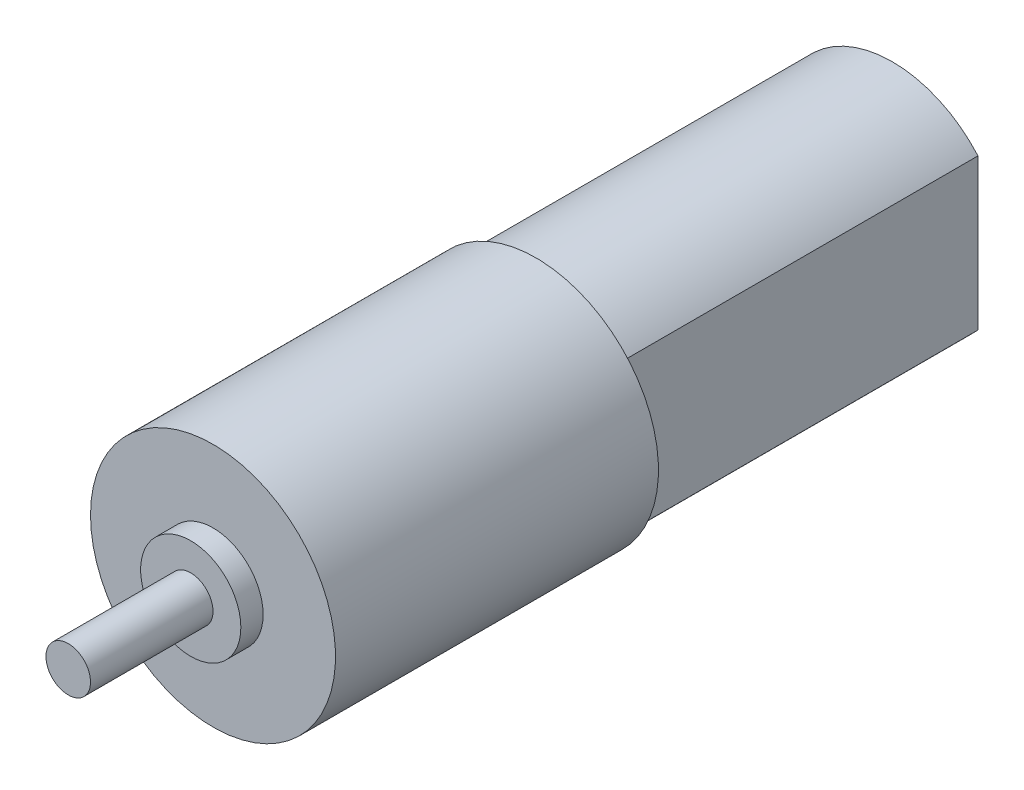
ISO-10303-21;
HEADER;
FILE_DESCRIPTION(('STEP AP214'),'2;1');
FILE_NAME('part.step','',(''),(''),'','','');
FILE_SCHEMA(('AUTOMOTIVE_DESIGN { 1 0 10303 214 1 1 1 1 }'));
ENDSEC;
DATA;
#1=APPLICATION_CONTEXT('core data for automotive mechanical design processes');
#2=APPLICATION_PROTOCOL_DEFINITION('international standard','automotive_design',2000,#1);
#3=PRODUCT_CONTEXT('',#1,'mechanical');
#4=PRODUCT('Part','Part','',(#3));
#5=PRODUCT_RELATED_PRODUCT_CATEGORY('part','',(#4));
#6=PRODUCT_DEFINITION_FORMATION('','',#4);
#7=PRODUCT_DEFINITION_CONTEXT('part definition',#1,'design');
#8=PRODUCT_DEFINITION('design','',#6,#7);
#9=PRODUCT_DEFINITION_SHAPE('','',#8);
#10=(LENGTH_UNIT() NAMED_UNIT(*) SI_UNIT(.MILLI.,.METRE.));
#11=(NAMED_UNIT(*) PLANE_ANGLE_UNIT() SI_UNIT($,.RADIAN.));
#12=(NAMED_UNIT(*) SI_UNIT($,.STERADIAN.) SOLID_ANGLE_UNIT());
#13=UNCERTAINTY_MEASURE_WITH_UNIT(LENGTH_MEASURE(1.E-05),#10,'distance_accuracy_value','');
#14=(GEOMETRIC_REPRESENTATION_CONTEXT(3) GLOBAL_UNCERTAINTY_ASSIGNED_CONTEXT((#13)) GLOBAL_UNIT_ASSIGNED_CONTEXT((#10,
#11,#12)) REPRESENTATION_CONTEXT('',''));
#15=CARTESIAN_POINT('',(0.,0.,0.));
#16=DIRECTION('',(0.,0.,1.));
#17=DIRECTION('',(1.,0.,0.));
#18=AXIS2_PLACEMENT_3D('',#15,#16,#17);
#19=CARTESIAN_POINT('',(0.,0.,61.));
#20=DIRECTION('',(0.,0.,-1.));
#21=DIRECTION('',(-1.,0.,0.));
#22=AXIS2_PLACEMENT_3D('',#19,#20,#21);
#23=CYLINDRICAL_SURFACE('',#22,11.);
#24=CARTESIAN_POINT('',(0.,0.,61.));
#25=DIRECTION('',(0.,0.,1.));
#26=DIRECTION('',(1.,0.,0.));
#27=AXIS2_PLACEMENT_3D('',#24,#25,#26);
#28=CIRCLE('',#27,11.);
#29=CARTESIAN_POINT('',(-11.,0.,61.));
#30=VERTEX_POINT('',#29);
#31=EDGE_CURVE('E108',#30,#30,#28,.T.);
#32=CARTESIAN_POINT('',(0.,0.,32.));
#33=DIRECTION('',(0.,0.,-1.));
#34=DIRECTION('',(-1.,0.,0.));
#35=AXIS2_PLACEMENT_3D('',#32,#33,#34);
#36=CIRCLE('',#35,11.);
#37=CARTESIAN_POINT('',(-11.,0.,32.));
#38=VERTEX_POINT('',#37);
#39=EDGE_CURVE('E113',#38,#38,#36,.T.);
#40=CARTESIAN_POINT('',(-11.,0.,61.));
#41=CARTESIAN_POINT('',(-11.,0.,60.6979166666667));
#42=CARTESIAN_POINT('',(-11.,0.,60.3958333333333));
#43=CARTESIAN_POINT('',(-11.,0.,59.7916666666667));
#44=CARTESIAN_POINT('',(-11.,0.,59.4895833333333));
#45=CARTESIAN_POINT('',(-11.,0.,58.8854166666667));
#46=CARTESIAN_POINT('',(-11.,0.,58.5833333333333));
#47=CARTESIAN_POINT('',(-11.,0.,57.9791666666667));
#48=CARTESIAN_POINT('',(-11.,0.,57.6770833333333));
#49=CARTESIAN_POINT('',(-11.,0.,57.0729166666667));
#50=CARTESIAN_POINT('',(-11.,0.,56.7708333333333));
#51=CARTESIAN_POINT('',(-11.,0.,56.1666666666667));
#52=CARTESIAN_POINT('',(-11.,0.,55.8645833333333));
#53=CARTESIAN_POINT('',(-11.,0.,55.2604166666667));
#54=CARTESIAN_POINT('',(-11.,0.,54.9583333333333));
#55=CARTESIAN_POINT('',(-11.,0.,54.3541666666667));
#56=CARTESIAN_POINT('',(-11.,0.,54.0520833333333));
#57=CARTESIAN_POINT('',(-11.,0.,53.4479166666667));
#58=CARTESIAN_POINT('',(-11.,0.,53.1458333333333));
#59=CARTESIAN_POINT('',(-11.,0.,52.5416666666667));
#60=CARTESIAN_POINT('',(-11.,0.,52.2395833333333));
#61=CARTESIAN_POINT('',(-11.,0.,51.6354166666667));
#62=CARTESIAN_POINT('',(-11.,0.,51.3333333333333));
#63=CARTESIAN_POINT('',(-11.,0.,50.7291666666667));
#64=CARTESIAN_POINT('',(-11.,0.,50.4270833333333));
#65=CARTESIAN_POINT('',(-11.,0.,49.8229166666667));
#66=CARTESIAN_POINT('',(-11.,0.,49.5208333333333));
#67=CARTESIAN_POINT('',(-11.,0.,48.9166666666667));
#68=CARTESIAN_POINT('',(-11.,0.,48.6145833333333));
#69=CARTESIAN_POINT('',(-11.,0.,48.0104166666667));
#70=CARTESIAN_POINT('',(-11.,0.,47.7083333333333));
#71=CARTESIAN_POINT('',(-11.,0.,47.1041666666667));
#72=CARTESIAN_POINT('',(-11.,0.,46.8020833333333));
#73=CARTESIAN_POINT('',(-11.,0.,46.1979166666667));
#74=CARTESIAN_POINT('',(-11.,0.,45.8958333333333));
#75=CARTESIAN_POINT('',(-11.,0.,45.2916666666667));
#76=CARTESIAN_POINT('',(-11.,0.,44.9895833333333));
#77=CARTESIAN_POINT('',(-11.,0.,44.3854166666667));
#78=CARTESIAN_POINT('',(-11.,0.,44.0833333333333));
#79=CARTESIAN_POINT('',(-11.,0.,43.4791666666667));
#80=CARTESIAN_POINT('',(-11.,0.,43.1770833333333));
#81=CARTESIAN_POINT('',(-11.,0.,42.5729166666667));
#82=CARTESIAN_POINT('',(-11.,0.,42.2708333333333));
#83=CARTESIAN_POINT('',(-11.,0.,41.6666666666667));
#84=CARTESIAN_POINT('',(-11.,0.,41.3645833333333));
#85=CARTESIAN_POINT('',(-11.,0.,40.7604166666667));
#86=CARTESIAN_POINT('',(-11.,0.,40.4583333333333));
#87=CARTESIAN_POINT('',(-11.,0.,39.8541666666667));
#88=CARTESIAN_POINT('',(-11.,0.,39.5520833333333));
#89=CARTESIAN_POINT('',(-11.,0.,38.9479166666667));
#90=CARTESIAN_POINT('',(-11.,0.,38.6458333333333));
#91=CARTESIAN_POINT('',(-11.,0.,38.0416666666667));
#92=CARTESIAN_POINT('',(-11.,0.,37.7395833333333));
#93=CARTESIAN_POINT('',(-11.,0.,37.1354166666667));
#94=CARTESIAN_POINT('',(-11.,0.,36.8333333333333));
#95=CARTESIAN_POINT('',(-11.,0.,36.2291666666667));
#96=CARTESIAN_POINT('',(-11.,0.,35.9270833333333));
#97=CARTESIAN_POINT('',(-11.,0.,35.3229166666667));
#98=CARTESIAN_POINT('',(-11.,0.,35.0208333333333));
#99=CARTESIAN_POINT('',(-11.,0.,34.4166666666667));
#100=CARTESIAN_POINT('',(-11.,0.,34.1145833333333));
#101=CARTESIAN_POINT('',(-11.,0.,33.5104166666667));
#102=CARTESIAN_POINT('',(-11.,0.,33.2083333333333));
#103=CARTESIAN_POINT('',(-11.,0.,32.6041666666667));
#104=CARTESIAN_POINT('',(-11.,0.,32.3020833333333));
#105=CARTESIAN_POINT('',(-11.,0.,32.));
#106=B_SPLINE_CURVE_WITH_KNOTS('',3,(#40,#41,#42,#43,#44,#45,#46,#47,#48,#49,#50,#51,#52,#53,
#54,#55,#56,#57,#58,#59,#60,#61,#62,#63,#64,#65,#66,#67,#68,#69,#70,#71,#72,#73,#74,#75,#76,#77,
#78,#79,#80,#81,#82,#83,#84,#85,#86,#87,#88,#89,#90,#91,#92,#93,#94,#95,#96,#97,#98,#99,#100,
#101,#102,#103,#104,#105),.UNSPECIFIED.,.F.,.F.,(4,2,2,2,2,2,2,2,2,2,2,2,2,2,2,2,2,2,2,2,2,2,2,
2,2,2,2,2,2,2,2,2,4),(0.,0.906250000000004,1.8125,2.71875000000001,3.625,4.53125,5.4375,6.34375,
7.25,8.15625,9.0625,9.96875,10.875,11.78125,12.6875,13.59375,14.5,15.40625,16.3125,17.21875,
18.125,19.03125,19.9375,20.84375,21.75,22.65625,23.5625,24.46875,25.375,26.28125,27.1875,
28.09375,29.),.UNSPECIFIED.);
#107=EDGE_CURVE('BSEAM31',#30,#38,#106,.T.);
#108=ORIENTED_EDGE('',*,*,#31,.F.);
#109=ORIENTED_EDGE('',*,*,#39,.F.);
#110=ORIENTED_EDGE('',*,*,#107,.T.);
#111=ORIENTED_EDGE('',*,*,#107,.F.);
#112=EDGE_LOOP('',(#108,#110,#109,#111));
#113=FACE_BOUND('',#112,.T.);
#114=ADVANCED_FACE('F31',(#113),#23,.T.);
#115=CARTESIAN_POINT('',(0.,0.,0.));
#116=DIRECTION('',(0.,0.,1.));
#117=DIRECTION('',(1.,0.,0.));
#118=AXIS2_PLACEMENT_3D('',#115,#116,#117);
#119=PLANE('',#118);
#120=CARTESIAN_POINT('',(0.,0.,0.));
#121=DIRECTION('',(0.,0.,-1.));
#122=DIRECTION('',(-1.,0.,0.));
#123=AXIS2_PLACEMENT_3D('',#120,#121,#122);
#124=CIRCLE('',#123,10.25);
#125=CARTESIAN_POINT('',(-7.806247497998,6.64266512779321,0.));
#126=VERTEX_POINT('',#125);
#127=CARTESIAN_POINT('',(7.693752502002,6.77264146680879,0.));
#128=VERTEX_POINT('',#127);
#129=EDGE_CURVE('E71',#126,#128,#124,.T.);
#130=ORIENTED_EDGE('',*,*,#129,.T.);
#131=DIRECTION('',(0.,1.,0.));
#132=VECTOR('',#131,1.);
#133=CARTESIAN_POINT('',(7.693752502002,7.86169017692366,0.));
#134=LINE('',#133,#132);
#135=CARTESIAN_POINT('',(7.693752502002,-6.77264146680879,0.));
#136=VERTEX_POINT('',#135);
#137=EDGE_CURVE('E99',#136,#128,#134,.T.);
#138=ORIENTED_EDGE('',*,*,#137,.F.);
#139=CARTESIAN_POINT('',(-7.806247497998,-6.64266512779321,0.));
#140=VERTEX_POINT('',#139);
#141=EDGE_CURVE('E52',#136,#140,#124,.T.);
#142=ORIENTED_EDGE('',*,*,#141,.T.);
#143=DIRECTION('',(0.,-1.,0.));
#144=VECTOR('',#143,1.);
#145=CARTESIAN_POINT('',(-7.806247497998,7.75,0.));
#146=LINE('',#145,#144);
#147=EDGE_CURVE('E92',#126,#140,#146,.T.);
#148=ORIENTED_EDGE('',*,*,#147,.F.);
#149=EDGE_LOOP('',(#130,#138,#142,#148));
#150=FACE_BOUND('',#149,.T.);
#151=ADVANCED_FACE('F123',(#150),#119,.F.);
#152=CARTESIAN_POINT('',(-7.806247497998,7.75,32.));
#153=DIRECTION('',(1.,0.,0.));
#154=DIRECTION('',(0.,0.,-1.));
#155=AXIS2_PLACEMENT_3D('',#152,#153,#154);
#156=PLANE('',#155);
#157=DIRECTION('',(0.,0.,-1.));
#158=VECTOR('',#157,1.);
#159=CARTESIAN_POINT('',(-7.806247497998,-6.64266512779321,32.));
#160=LINE('',#159,#158);
#161=CARTESIAN_POINT('',(-7.806247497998,-6.64266512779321,32.));
#162=VERTEX_POINT('',#161);
#163=EDGE_CURVE('E76',#162,#140,#160,.T.);
#164=ORIENTED_EDGE('',*,*,#163,.F.);
#165=DIRECTION('',(0.,-1.,0.));
#166=VECTOR('',#165,1.);
#167=CARTESIAN_POINT('',(-7.806247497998,7.75,32.));
#168=LINE('',#167,#166);
#169=CARTESIAN_POINT('',(-7.806247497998,6.64266512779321,32.));
#170=VERTEX_POINT('',#169);
#171=EDGE_CURVE('E84',#170,#162,#168,.T.);
#172=ORIENTED_EDGE('',*,*,#171,.F.);
#173=DIRECTION('',(0.,0.,-1.));
#174=VECTOR('',#173,1.);
#175=CARTESIAN_POINT('',(-7.806247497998,6.64266512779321,32.));
#176=LINE('',#175,#174);
#177=EDGE_CURVE('E68',#126,#170,#176,.F.);
#178=ORIENTED_EDGE('',*,*,#177,.F.);
#179=ORIENTED_EDGE('',*,*,#147,.T.);
#180=EDGE_LOOP('',(#164,#172,#178,#179));
#181=FACE_BOUND('',#180,.T.);
#182=ADVANCED_FACE('F90',(#181),#156,.F.);
#183=CARTESIAN_POINT('',(7.693752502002,7.86169017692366,32.));
#184=DIRECTION('',(-1.,0.,0.));
#185=DIRECTION('',(0.,0.,1.));
#186=AXIS2_PLACEMENT_3D('',#183,#184,#185);
#187=PLANE('',#186);
#188=DIRECTION('',(0.,0.,-1.));
#189=VECTOR('',#188,1.);
#190=CARTESIAN_POINT('',(7.693752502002,6.77264146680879,32.));
#191=LINE('',#190,#189);
#192=CARTESIAN_POINT('',(7.693752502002,6.77264146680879,32.));
#193=VERTEX_POINT('',#192);
#194=EDGE_CURVE('E12',#193,#128,#191,.T.);
#195=ORIENTED_EDGE('',*,*,#194,.F.);
#196=DIRECTION('',(0.,1.,0.));
#197=VECTOR('',#196,1.);
#198=CARTESIAN_POINT('',(7.693752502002,7.86169017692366,32.));
#199=LINE('',#198,#197);
#200=CARTESIAN_POINT('',(7.693752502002,-6.77264146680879,32.));
#201=VERTEX_POINT('',#200);
#202=EDGE_CURVE('E86',#201,#193,#199,.T.);
#203=ORIENTED_EDGE('',*,*,#202,.F.);
#204=DIRECTION('',(0.,0.,-1.));
#205=VECTOR('',#204,1.);
#206=CARTESIAN_POINT('',(7.693752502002,-6.77264146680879,32.));
#207=LINE('',#206,#205);
#208=EDGE_CURVE('E38',#136,#201,#207,.F.);
#209=ORIENTED_EDGE('',*,*,#208,.F.);
#210=ORIENTED_EDGE('',*,*,#137,.T.);
#211=EDGE_LOOP('',(#195,#203,#209,#210));
#212=FACE_BOUND('',#211,.T.);
#213=ADVANCED_FACE('F119',(#212),#187,.F.);
#214=CARTESIAN_POINT('',(0.,0.,63.));
#215=DIRECTION('',(0.,0.,1.));
#216=DIRECTION('',(1.,0.,0.));
#217=AXIS2_PLACEMENT_3D('',#214,#215,#216);
#218=PLANE('',#217);
#219=CARTESIAN_POINT('',(0.,0.,63.));
#220=DIRECTION('',(0.,0.,1.));
#221=DIRECTION('',(1.,0.,0.));
#222=AXIS2_PLACEMENT_3D('',#219,#220,#221);
#223=CIRCLE('',#222,4.5);
#224=CARTESIAN_POINT('',(4.5,0.,63.));
#225=VERTEX_POINT('',#224);
#226=EDGE_CURVE('E105',#225,#225,#223,.T.);
#227=ORIENTED_EDGE('',*,*,#226,.T.);
#228=EDGE_LOOP('',(#227));
#229=FACE_BOUND('',#228,.T.);
#230=CARTESIAN_POINT('',(0.,0.,63.));
#231=DIRECTION('',(0.,0.,1.));
#232=DIRECTION('',(1.,0.,0.));
#233=AXIS2_PLACEMENT_3D('',#230,#231,#232);
#234=CIRCLE('',#233,2.);
#235=CARTESIAN_POINT('',(2.,0.,63.));
#236=VERTEX_POINT('',#235);
#237=EDGE_CURVE('E91',#236,#236,#234,.T.);
#238=ORIENTED_EDGE('',*,*,#237,.F.);
#239=EDGE_LOOP('',(#238));
#240=FACE_BOUND('',#239,.T.);
#241=ADVANCED_FACE('F136',(#229,#240),#218,.T.);
#242=CARTESIAN_POINT('',(0.,0.,61.));
#243=DIRECTION('',(0.,0.,1.));
#244=DIRECTION('',(1.,0.,0.));
#245=AXIS2_PLACEMENT_3D('',#242,#243,#244);
#246=PLANE('',#245);
#247=ORIENTED_EDGE('',*,*,#31,.T.);
#248=EDGE_LOOP('',(#247));
#249=FACE_BOUND('',#248,.T.);
#250=CARTESIAN_POINT('',(0.,0.,61.));
#251=DIRECTION('',(0.,0.,1.));
#252=DIRECTION('',(1.,0.,0.));
#253=AXIS2_PLACEMENT_3D('',#250,#251,#252);
#254=CIRCLE('',#253,4.5);
#255=CARTESIAN_POINT('',(4.5,0.,61.));
#256=VERTEX_POINT('',#255);
#257=EDGE_CURVE('E103',#256,#256,#254,.T.);
#258=ORIENTED_EDGE('',*,*,#257,.F.);
#259=EDGE_LOOP('',(#258));
#260=FACE_BOUND('',#259,.T.);
#261=ADVANCED_FACE('F132',(#249,#260),#246,.T.);
#262=CARTESIAN_POINT('',(0.,0.,63.));
#263=DIRECTION('',(0.,0.,-1.));
#264=DIRECTION('',(-1.,0.,0.));
#265=AXIS2_PLACEMENT_3D('',#262,#263,#264);
#266=CYLINDRICAL_SURFACE('',#265,4.5);
#267=ORIENTED_EDGE('',*,*,#226,.F.);
#268=EDGE_LOOP('',(#267));
#269=FACE_BOUND('',#268,.T.);
#270=ORIENTED_EDGE('',*,*,#257,.T.);
#271=EDGE_LOOP('',(#270));
#272=FACE_BOUND('',#271,.T.);
#273=ADVANCED_FACE('F135',(#269,#272),#266,.T.);
#274=CARTESIAN_POINT('',(0.,0.,74.));
#275=DIRECTION('',(0.,0.,-1.));
#276=DIRECTION('',(-1.,0.,0.));
#277=AXIS2_PLACEMENT_3D('',#274,#275,#276);
#278=CYLINDRICAL_SURFACE('',#277,2.);
#279=CARTESIAN_POINT('',(0.,0.,74.));
#280=DIRECTION('',(0.,0.,1.));
#281=DIRECTION('',(1.,0.,0.));
#282=AXIS2_PLACEMENT_3D('',#279,#280,#281);
#283=CIRCLE('',#282,2.);
#284=CARTESIAN_POINT('',(2.,0.,74.));
#285=VERTEX_POINT('',#284);
#286=EDGE_CURVE('E95',#285,#285,#283,.T.);
#287=ORIENTED_EDGE('',*,*,#286,.F.);
#288=EDGE_LOOP('',(#287));
#289=FACE_BOUND('',#288,.T.);
#290=ORIENTED_EDGE('',*,*,#237,.T.);
#291=EDGE_LOOP('',(#290));
#292=FACE_BOUND('',#291,.T.);
#293=ADVANCED_FACE('F140',(#289,#292),#278,.T.);
#294=CARTESIAN_POINT('',(0.,0.,74.));
#295=DIRECTION('',(0.,0.,1.));
#296=DIRECTION('',(1.,0.,0.));
#297=AXIS2_PLACEMENT_3D('',#294,#295,#296);
#298=PLANE('',#297);
#299=ORIENTED_EDGE('',*,*,#286,.T.);
#300=EDGE_LOOP('',(#299));
#301=FACE_BOUND('',#300,.T.);
#302=ADVANCED_FACE('F147',(#301),#298,.T.);
#303=CARTESIAN_POINT('',(-7.806247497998,-7.75,32.));
#304=DIRECTION('',(0.,0.,-1.));
#305=DIRECTION('',(-1.,0.,0.));
#306=AXIS2_PLACEMENT_3D('',#303,#304,#305);
#307=PLANE('',#306);
#308=CARTESIAN_POINT('',(0.,0.,32.));
#309=DIRECTION('',(0.,0.,-1.));
#310=DIRECTION('',(-1.,0.,0.));
#311=AXIS2_PLACEMENT_3D('',#308,#309,#310);
#312=CIRCLE('',#311,10.25);
#313=EDGE_CURVE('E44',#170,#193,#312,.T.);
#314=ORIENTED_EDGE('',*,*,#313,.F.);
#315=ORIENTED_EDGE('',*,*,#171,.T.);
#316=EDGE_CURVE('E87',#201,#162,#312,.T.);
#317=ORIENTED_EDGE('',*,*,#316,.F.);
#318=ORIENTED_EDGE('',*,*,#202,.T.);
#319=EDGE_LOOP('',(#314,#315,#317,#318));
#320=FACE_BOUND('',#319,.T.);
#321=ORIENTED_EDGE('',*,*,#39,.T.);
#322=EDGE_LOOP('',(#321));
#323=FACE_BOUND('',#322,.T.);
#324=ADVANCED_FACE('F81',(#320,#323),#307,.T.);
#325=CARTESIAN_POINT('',(0.,0.,32.));
#326=DIRECTION('',(0.,0.,-1.));
#327=DIRECTION('',(-1.,0.,0.));
#328=AXIS2_PLACEMENT_3D('',#325,#326,#327);
#329=CYLINDRICAL_SURFACE('',#328,10.25);
#330=ORIENTED_EDGE('',*,*,#163,.T.);
#331=ORIENTED_EDGE('',*,*,#141,.F.);
#332=ORIENTED_EDGE('',*,*,#208,.T.);
#333=ORIENTED_EDGE('',*,*,#316,.T.);
#334=EDGE_LOOP('',(#330,#331,#332,#333));
#335=FACE_BOUND('',#334,.T.);
#336=ADVANCED_FACE('F115',(#335),#329,.T.);
#337=ORIENTED_EDGE('',*,*,#177,.T.);
#338=ORIENTED_EDGE('',*,*,#313,.T.);
#339=ORIENTED_EDGE('',*,*,#194,.T.);
#340=ORIENTED_EDGE('',*,*,#129,.F.);
#341=EDGE_LOOP('',(#337,#338,#339,#340));
#342=FACE_BOUND('',#341,.T.);
#343=ADVANCED_FACE('F69',(#342),#329,.T.);
#344=CLOSED_SHELL('',(#114,#151,#182,#213,#241,#261,#273,#293,#302,#324,#336,#343));
#345=MANIFOLD_SOLID_BREP('B2',#344);
#346=ADVANCED_BREP_SHAPE_REPRESENTATION('',(#18,#345),#14);
#347=SHAPE_DEFINITION_REPRESENTATION(#9,#346);
ENDSEC;
END-ISO-10303-21;
